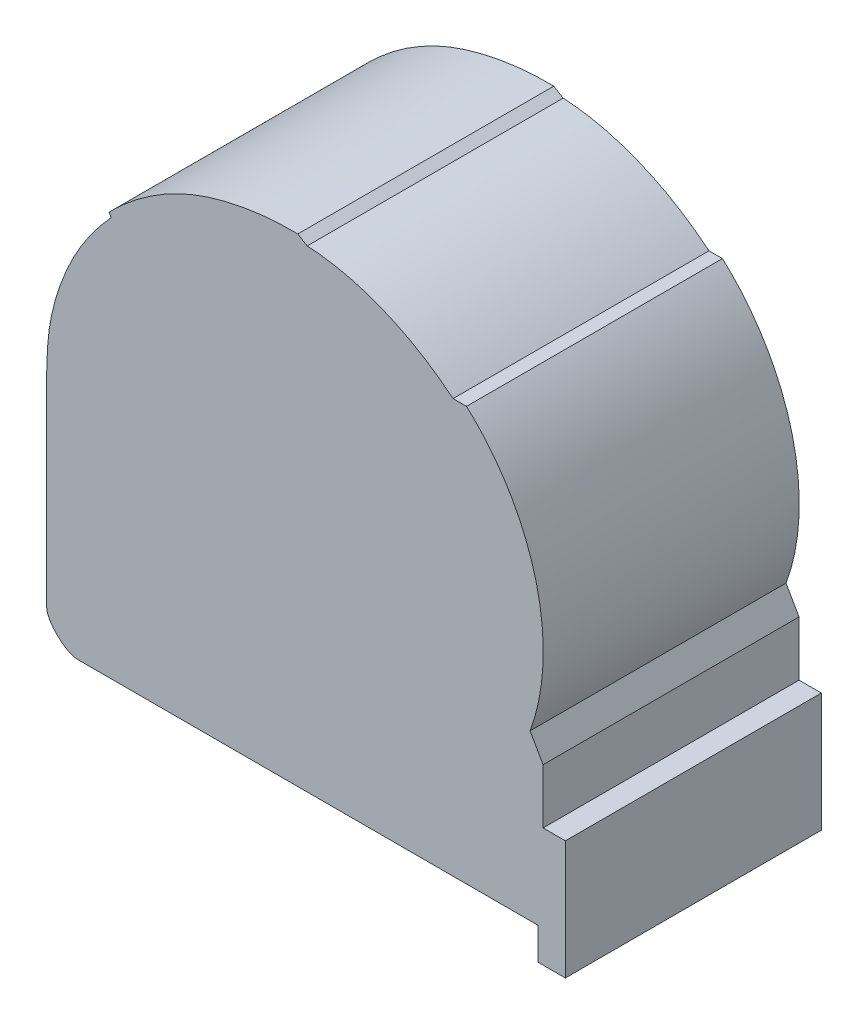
ISO-10303-21;
HEADER;
FILE_DESCRIPTION(('STEP AP214'),'2;1');
FILE_NAME('part.step','',(''),(''),'','','');
FILE_SCHEMA(('AUTOMOTIVE_DESIGN { 1 0 10303 214 1 1 1 1 }'));
ENDSEC;
DATA;
#1=APPLICATION_CONTEXT('core data for automotive mechanical design processes');
#2=APPLICATION_PROTOCOL_DEFINITION('international standard','automotive_design',2000,#1);
#3=PRODUCT_CONTEXT('',#1,'mechanical');
#4=PRODUCT('Part','Part','',(#3));
#5=PRODUCT_RELATED_PRODUCT_CATEGORY('part','',(#4));
#6=PRODUCT_DEFINITION_FORMATION('','',#4);
#7=PRODUCT_DEFINITION_CONTEXT('part definition',#1,'design');
#8=PRODUCT_DEFINITION('design','',#6,#7);
#9=PRODUCT_DEFINITION_SHAPE('','',#8);
#10=(LENGTH_UNIT() NAMED_UNIT(*) SI_UNIT(.MILLI.,.METRE.));
#11=(NAMED_UNIT(*) PLANE_ANGLE_UNIT() SI_UNIT($,.RADIAN.));
#12=(NAMED_UNIT(*) SI_UNIT($,.STERADIAN.) SOLID_ANGLE_UNIT());
#13=UNCERTAINTY_MEASURE_WITH_UNIT(LENGTH_MEASURE(1.E-05),#10,'distance_accuracy_value','');
#14=(GEOMETRIC_REPRESENTATION_CONTEXT(3) GLOBAL_UNCERTAINTY_ASSIGNED_CONTEXT((#13)) GLOBAL_UNIT_ASSIGNED_CONTEXT((#10,
#11,#12)) REPRESENTATION_CONTEXT('',''));
#15=CARTESIAN_POINT('',(0.,0.,0.));
#16=DIRECTION('',(0.,0.,1.));
#17=DIRECTION('',(1.,0.,0.));
#18=AXIS2_PLACEMENT_3D('',#15,#16,#17);
#19=CARTESIAN_POINT('',(-4.07433588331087,3.88304770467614,33.));
#20=CARTESIAN_POINT('',(-4.07433588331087,3.25454149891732,33.));
#21=CARTESIAN_POINT('',(-3.46541502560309,2.14685009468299,33.));
#22=CARTESIAN_POINT('',(-2.12049855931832,0.762348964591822,33.));
#23=CARTESIAN_POINT('',(-0.845653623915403,0.,33.));
#24=CARTESIAN_POINT('',(0.,0.,33.));
#25=B_SPLINE_CURVE_WITH_KNOTS('',3,(#19,#20,#21,#22,#23,#24),.UNSPECIFIED.,.F.,.F.,(4,1,1,4),
(0.,0.32203565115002,0.577642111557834,1.),.UNSPECIFIED.);
#26=DIRECTION('',(0.,0.,-1.));
#27=VECTOR('',#26,1.);
#28=SURFACE_OF_LINEAR_EXTRUSION('',#25,#27);
#29=CARTESIAN_POINT('',(-4.07433588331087,3.88304770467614,0.));
#30=CARTESIAN_POINT('',(-4.07433588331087,3.25454149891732,0.));
#31=CARTESIAN_POINT('',(-3.46541502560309,2.14685009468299,0.));
#32=CARTESIAN_POINT('',(-2.12049855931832,0.762348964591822,0.));
#33=CARTESIAN_POINT('',(-0.845653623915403,0.,0.));
#34=CARTESIAN_POINT('',(0.,0.,0.));
#35=B_SPLINE_CURVE_WITH_KNOTS('',3,(#29,#30,#31,#32,#33,#34),.UNSPECIFIED.,.F.,.F.,(4,1,1,4),
(0.,0.32203565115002,0.577642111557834,1.),.UNSPECIFIED.);
#36=CARTESIAN_POINT('',(-4.07433588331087,3.88304770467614,0.));
#37=VERTEX_POINT('',#36);
#38=CARTESIAN_POINT('',(0.,0.,0.));
#39=VERTEX_POINT('',#38);
#40=EDGE_CURVE('E200',#37,#39,#35,.T.);
#41=ORIENTED_EDGE('',*,*,#40,.T.);
#42=DIRECTION('',(0.,0.,-1.));
#43=VECTOR('',#42,1.);
#44=CARTESIAN_POINT('',(0.,0.,33.));
#45=LINE('',#44,#43);
#46=CARTESIAN_POINT('',(0.,0.,33.));
#47=VERTEX_POINT('',#46);
#48=EDGE_CURVE('E11',#47,#39,#45,.T.);
#49=ORIENTED_EDGE('',*,*,#48,.F.);
#50=CARTESIAN_POINT('',(-4.07433588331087,3.88304770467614,33.));
#51=VERTEX_POINT('',#50);
#52=EDGE_CURVE('E210',#51,#47,#25,.T.);
#53=ORIENTED_EDGE('',*,*,#52,.F.);
#54=DIRECTION('',(0.,0.,-1.));
#55=VECTOR('',#54,1.);
#56=CARTESIAN_POINT('',(-4.07433588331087,3.88304770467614,33.));
#57=LINE('',#56,#55);
#58=EDGE_CURVE('E369',#51,#37,#57,.T.);
#59=ORIENTED_EDGE('',*,*,#58,.T.);
#60=EDGE_LOOP('',(#41,#49,#53,#59));
#61=FACE_BOUND('',#60,.T.);
#62=ADVANCED_FACE('F39',(#61),#28,.F.);
#63=CARTESIAN_POINT('',(0.,0.,33.));
#64=DIRECTION('',(0.,1.,0.));
#65=DIRECTION('',(0.,0.,1.));
#66=AXIS2_PLACEMENT_3D('',#63,#64,#65);
#67=PLANE('',#66);
#68=DIRECTION('',(1.,0.,0.));
#69=VECTOR('',#68,1.);
#70=CARTESIAN_POINT('',(0.,0.,0.));
#71=LINE('',#70,#69);
#72=CARTESIAN_POINT('',(59.2961636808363,0.,0.));
#73=VERTEX_POINT('',#72);
#74=EDGE_CURVE('E205',#39,#73,#71,.T.);
#75=ORIENTED_EDGE('',*,*,#74,.T.);
#76=DIRECTION('',(0.,0.,-1.));
#77=VECTOR('',#76,1.);
#78=CARTESIAN_POINT('',(59.2961636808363,0.,33.));
#79=LINE('',#78,#77);
#80=CARTESIAN_POINT('',(59.2961636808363,0.,33.));
#81=VERTEX_POINT('',#80);
#82=EDGE_CURVE('E48',#81,#73,#79,.T.);
#83=ORIENTED_EDGE('',*,*,#82,.F.);
#84=DIRECTION('',(1.,0.,0.));
#85=VECTOR('',#84,1.);
#86=CARTESIAN_POINT('',(0.,0.,33.));
#87=LINE('',#86,#85);
#88=EDGE_CURVE('E217',#47,#81,#87,.T.);
#89=ORIENTED_EDGE('',*,*,#88,.F.);
#90=ORIENTED_EDGE('',*,*,#48,.T.);
#91=EDGE_LOOP('',(#75,#83,#89,#90));
#92=FACE_BOUND('',#91,.T.);
#93=ADVANCED_FACE('F283',(#92),#67,.F.);
#94=CARTESIAN_POINT('',(59.2961636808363,0.,33.));
#95=DIRECTION('',(1.,0.,0.));
#96=DIRECTION('',(0.,0.,-1.));
#97=AXIS2_PLACEMENT_3D('',#94,#95,#96);
#98=PLANE('',#97);
#99=DIRECTION('',(0.,-1.,0.));
#100=VECTOR('',#99,1.);
#101=CARTESIAN_POINT('',(59.2961636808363,0.,0.));
#102=LINE('',#101,#100);
#103=CARTESIAN_POINT('',(59.2961636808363,-4.12477551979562,0.));
#104=VERTEX_POINT('',#103);
#105=EDGE_CURVE('E299',#73,#104,#102,.T.);
#106=ORIENTED_EDGE('',*,*,#105,.T.);
#107=DIRECTION('',(0.,0.,-1.));
#108=VECTOR('',#107,1.);
#109=CARTESIAN_POINT('',(59.2961636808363,-4.12477551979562,33.));
#110=LINE('',#109,#108);
#111=CARTESIAN_POINT('',(59.2961636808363,-4.12477551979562,33.));
#112=VERTEX_POINT('',#111);
#113=EDGE_CURVE('E304',#112,#104,#110,.T.);
#114=ORIENTED_EDGE('',*,*,#113,.F.);
#115=DIRECTION('',(0.,-1.,0.));
#116=VECTOR('',#115,1.);
#117=CARTESIAN_POINT('',(59.2961636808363,0.,33.));
#118=LINE('',#117,#116);
#119=EDGE_CURVE('E224',#81,#112,#118,.T.);
#120=ORIENTED_EDGE('',*,*,#119,.F.);
#121=ORIENTED_EDGE('',*,*,#82,.T.);
#122=EDGE_LOOP('',(#106,#114,#120,#121));
#123=FACE_BOUND('',#122,.T.);
#124=ADVANCED_FACE('F280',(#123),#98,.F.);
#125=CARTESIAN_POINT('',(59.2961636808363,-4.12477551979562,33.));
#126=DIRECTION('',(0.,1.,0.));
#127=DIRECTION('',(0.,0.,1.));
#128=AXIS2_PLACEMENT_3D('',#125,#126,#127);
#129=PLANE('',#128);
#130=DIRECTION('',(1.,0.,0.));
#131=VECTOR('',#130,1.);
#132=CARTESIAN_POINT('',(59.2961636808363,-4.12477551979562,0.));
#133=LINE('',#132,#131);
#134=CARTESIAN_POINT('',(62.7961636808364,-4.12477551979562,0.));
#135=VERTEX_POINT('',#134);
#136=EDGE_CURVE('E308',#104,#135,#133,.T.);
#137=ORIENTED_EDGE('',*,*,#136,.T.);
#138=DIRECTION('',(0.,0.,-1.));
#139=VECTOR('',#138,1.);
#140=CARTESIAN_POINT('',(62.7961636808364,-4.12477551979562,33.));
#141=LINE('',#140,#139);
#142=CARTESIAN_POINT('',(62.7961636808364,-4.12477551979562,33.));
#143=VERTEX_POINT('',#142);
#144=EDGE_CURVE('E418',#143,#135,#141,.T.);
#145=ORIENTED_EDGE('',*,*,#144,.F.);
#146=DIRECTION('',(1.,0.,0.));
#147=VECTOR('',#146,1.);
#148=CARTESIAN_POINT('',(59.2961636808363,-4.12477551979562,33.));
#149=LINE('',#148,#147);
#150=EDGE_CURVE('E227',#112,#143,#149,.T.);
#151=ORIENTED_EDGE('',*,*,#150,.F.);
#152=ORIENTED_EDGE('',*,*,#113,.T.);
#153=EDGE_LOOP('',(#137,#145,#151,#152));
#154=FACE_BOUND('',#153,.T.);
#155=ADVANCED_FACE('F276',(#154),#129,.F.);
#156=CARTESIAN_POINT('',(62.7961636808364,-4.12477551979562,33.));
#157=DIRECTION('',(-1.,0.,0.));
#158=DIRECTION('',(0.,0.,1.));
#159=AXIS2_PLACEMENT_3D('',#156,#157,#158);
#160=PLANE('',#159);
#161=DIRECTION('',(0.,1.,0.));
#162=VECTOR('',#161,1.);
#163=CARTESIAN_POINT('',(62.7961636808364,-4.12477551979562,0.));
#164=LINE('',#163,#162);
#165=CARTESIAN_POINT('',(62.7961636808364,11.1930684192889,0.));
#166=VERTEX_POINT('',#165);
#167=EDGE_CURVE('E312',#135,#166,#164,.T.);
#168=ORIENTED_EDGE('',*,*,#167,.T.);
#169=DIRECTION('',(0.,0.,-1.));
#170=VECTOR('',#169,1.);
#171=CARTESIAN_POINT('',(62.7961636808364,11.1930684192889,33.));
#172=LINE('',#171,#170);
#173=CARTESIAN_POINT('',(62.7961636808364,11.1930684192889,33.));
#174=VERTEX_POINT('',#173);
#175=EDGE_CURVE('E414',#174,#166,#172,.T.);
#176=ORIENTED_EDGE('',*,*,#175,.F.);
#177=DIRECTION('',(0.,1.,0.));
#178=VECTOR('',#177,1.);
#179=CARTESIAN_POINT('',(62.7961636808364,-4.12477551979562,33.));
#180=LINE('',#179,#178);
#181=EDGE_CURVE('E230',#143,#174,#180,.T.);
#182=ORIENTED_EDGE('',*,*,#181,.F.);
#183=ORIENTED_EDGE('',*,*,#144,.T.);
#184=EDGE_LOOP('',(#168,#176,#182,#183));
#185=FACE_BOUND('',#184,.T.);
#186=ADVANCED_FACE('F272',(#185),#160,.F.);
#187=CARTESIAN_POINT('',(62.7961636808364,11.1930684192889,33.));
#188=DIRECTION('',(0.,-1.,0.));
#189=DIRECTION('',(0.,0.,-1.));
#190=AXIS2_PLACEMENT_3D('',#187,#188,#189);
#191=PLANE('',#190);
#192=DIRECTION('',(-1.,0.,0.));
#193=VECTOR('',#192,1.);
#194=CARTESIAN_POINT('',(62.7961636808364,11.1930684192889,0.));
#195=LINE('',#194,#193);
#196=CARTESIAN_POINT('',(59.9256641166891,11.1930684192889,0.));
#197=VERTEX_POINT('',#196);
#198=EDGE_CURVE('E317',#166,#197,#195,.T.);
#199=ORIENTED_EDGE('',*,*,#198,.T.);
#200=DIRECTION('',(0.,0.,-1.));
#201=VECTOR('',#200,1.);
#202=CARTESIAN_POINT('',(59.9256641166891,11.1930684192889,33.));
#203=LINE('',#202,#201);
#204=CARTESIAN_POINT('',(59.9256641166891,11.1930684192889,33.));
#205=VERTEX_POINT('',#204);
#206=EDGE_CURVE('E410',#205,#197,#203,.T.);
#207=ORIENTED_EDGE('',*,*,#206,.F.);
#208=DIRECTION('',(-1.,0.,0.));
#209=VECTOR('',#208,1.);
#210=CARTESIAN_POINT('',(62.7961636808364,11.1930684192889,33.));
#211=LINE('',#210,#209);
#212=EDGE_CURVE('E233',#174,#205,#211,.T.);
#213=ORIENTED_EDGE('',*,*,#212,.F.);
#214=ORIENTED_EDGE('',*,*,#175,.T.);
#215=EDGE_LOOP('',(#199,#207,#213,#214));
#216=FACE_BOUND('',#215,.T.);
#217=ADVANCED_FACE('F268',(#216),#191,.F.);
#218=CARTESIAN_POINT('',(59.9256641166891,11.1930684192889,33.));
#219=DIRECTION('',(-1.,0.,0.));
#220=DIRECTION('',(0.,0.,1.));
#221=AXIS2_PLACEMENT_3D('',#218,#219,#220);
#222=PLANE('',#221);
#223=DIRECTION('',(0.,1.,0.));
#224=VECTOR('',#223,1.);
#225=CARTESIAN_POINT('',(59.9256641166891,11.1930684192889,0.));
#226=LINE('',#225,#224);
#227=CARTESIAN_POINT('',(59.9256641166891,18.2574621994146,0.));
#228=VERTEX_POINT('',#227);
#229=EDGE_CURVE('E320',#197,#228,#226,.T.);
#230=ORIENTED_EDGE('',*,*,#229,.T.);
#231=DIRECTION('',(0.,0.,-1.));
#232=VECTOR('',#231,1.);
#233=CARTESIAN_POINT('',(59.9256641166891,18.2574621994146,33.));
#234=LINE('',#233,#232);
#235=CARTESIAN_POINT('',(59.9256641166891,18.2574621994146,33.));
#236=VERTEX_POINT('',#235);
#237=EDGE_CURVE('E406',#236,#228,#234,.T.);
#238=ORIENTED_EDGE('',*,*,#237,.F.);
#239=DIRECTION('',(0.,1.,0.));
#240=VECTOR('',#239,1.);
#241=CARTESIAN_POINT('',(59.9256641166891,11.1930684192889,33.));
#242=LINE('',#241,#240);
#243=EDGE_CURVE('E236',#205,#236,#242,.T.);
#244=ORIENTED_EDGE('',*,*,#243,.F.);
#245=ORIENTED_EDGE('',*,*,#206,.T.);
#246=EDGE_LOOP('',(#230,#238,#244,#245));
#247=FACE_BOUND('',#246,.T.);
#248=ADVANCED_FACE('F264',(#247),#222,.F.);
#249=CARTESIAN_POINT('',(59.9256641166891,18.2574621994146,33.));
#250=DIRECTION('',(-0.868243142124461,-0.49613893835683,0.));
#251=DIRECTION('',(0.49613893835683,-0.868243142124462,0.));
#252=AXIS2_PLACEMENT_3D('',#249,#250,#251);
#253=PLANE('',#252);
#254=DIRECTION('',(-0.49613893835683,0.868243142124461,0.));
#255=VECTOR('',#254,1.);
#256=CARTESIAN_POINT('',(59.9256641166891,18.2574621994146,0.));
#257=LINE('',#256,#255);
#258=CARTESIAN_POINT('',(58.2469962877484,21.195130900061,0.));
#259=VERTEX_POINT('',#258);
#260=EDGE_CURVE('E323',#228,#259,#257,.T.);
#261=ORIENTED_EDGE('',*,*,#260,.T.);
#262=DIRECTION('',(0.,0.,-1.));
#263=VECTOR('',#262,1.);
#264=CARTESIAN_POINT('',(58.2469962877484,21.195130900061,33.));
#265=LINE('',#264,#263);
#266=CARTESIAN_POINT('',(58.2469962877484,21.195130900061,33.));
#267=VERTEX_POINT('',#266);
#268=EDGE_CURVE('E402',#267,#259,#265,.T.);
#269=ORIENTED_EDGE('',*,*,#268,.F.);
#270=DIRECTION('',(-0.49613893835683,0.868243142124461,0.));
#271=VECTOR('',#270,1.);
#272=CARTESIAN_POINT('',(59.9256641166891,18.2574621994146,33.));
#273=LINE('',#272,#271);
#274=EDGE_CURVE('E239',#236,#267,#273,.T.);
#275=ORIENTED_EDGE('',*,*,#274,.F.);
#276=ORIENTED_EDGE('',*,*,#237,.T.);
#277=EDGE_LOOP('',(#261,#269,#275,#276));
#278=FACE_BOUND('',#277,.T.);
#279=ADVANCED_FACE('F259',(#278),#253,.F.);
#280=CARTESIAN_POINT('',(58.2469962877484,21.195130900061,33.));
#281=CARTESIAN_POINT('',(59.7340703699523,25.2058668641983,33.));
#282=CARTESIAN_POINT('',(61.0733717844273,37.1119587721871,33.));
#283=CARTESIAN_POINT('',(55.5968499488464,48.294383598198,33.));
#284=CARTESIAN_POINT('',(50.051226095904,53.3278054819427,33.));
#285=B_SPLINE_CURVE_WITH_KNOTS('',3,(#280,#281,#282,#283,#284),.UNSPECIFIED.,.F.,.F.,(4,1,4),
(0.,0.366433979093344,1.),.UNSPECIFIED.);
#286=DIRECTION('',(0.,0.,-1.));
#287=VECTOR('',#286,1.);
#288=SURFACE_OF_LINEAR_EXTRUSION('',#285,#287);
#289=CARTESIAN_POINT('',(58.2469962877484,21.195130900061,0.));
#290=CARTESIAN_POINT('',(59.7340703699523,25.2058668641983,0.));
#291=CARTESIAN_POINT('',(61.0733717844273,37.1119587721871,0.));
#292=CARTESIAN_POINT('',(55.5968499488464,48.294383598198,0.));
#293=CARTESIAN_POINT('',(50.051226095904,53.3278054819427,0.));
#294=B_SPLINE_CURVE_WITH_KNOTS('',3,(#289,#290,#291,#292,#293),.UNSPECIFIED.,.F.,.F.,(4,1,4),
(0.,0.366433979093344,1.),.UNSPECIFIED.);
#295=CARTESIAN_POINT('',(50.051226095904,53.3278054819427,0.));
#296=VERTEX_POINT('',#295);
#297=EDGE_CURVE('E326',#259,#296,#294,.T.);
#298=ORIENTED_EDGE('',*,*,#297,.T.);
#299=DIRECTION('',(0.,0.,-1.));
#300=VECTOR('',#299,1.);
#301=CARTESIAN_POINT('',(50.051226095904,53.3278054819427,33.));
#302=LINE('',#301,#300);
#303=CARTESIAN_POINT('',(50.051226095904,53.3278054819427,33.));
#304=VERTEX_POINT('',#303);
#305=EDGE_CURVE('E398',#304,#296,#302,.T.);
#306=ORIENTED_EDGE('',*,*,#305,.F.);
#307=EDGE_CURVE('E242',#267,#304,#285,.T.);
#308=ORIENTED_EDGE('',*,*,#307,.F.);
#309=ORIENTED_EDGE('',*,*,#268,.T.);
#310=EDGE_LOOP('',(#298,#306,#308,#309));
#311=FACE_BOUND('',#310,.T.);
#312=ADVANCED_FACE('F254',(#311),#288,.F.);
#313=CARTESIAN_POINT('',(50.051226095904,53.3278054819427,33.));
#314=DIRECTION('',(0.,-1.,0.));
#315=DIRECTION('',(0.,0.,-1.));
#316=AXIS2_PLACEMENT_3D('',#313,#314,#315);
#317=PLANE('',#316);
#318=DIRECTION('',(-1.,0.,0.));
#319=VECTOR('',#318,1.);
#320=CARTESIAN_POINT('',(50.051226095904,53.3278054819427,0.));
#321=LINE('',#320,#319);
#322=CARTESIAN_POINT('',(48.3164308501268,53.3278054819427,0.));
#323=VERTEX_POINT('',#322);
#324=EDGE_CURVE('E331',#296,#323,#321,.T.);
#325=ORIENTED_EDGE('',*,*,#324,.T.);
#326=DIRECTION('',(0.,0.,-1.));
#327=VECTOR('',#326,1.);
#328=CARTESIAN_POINT('',(48.3164308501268,53.3278054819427,33.));
#329=LINE('',#328,#327);
#330=CARTESIAN_POINT('',(48.3164308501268,53.3278054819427,33.));
#331=VERTEX_POINT('',#330);
#332=EDGE_CURVE('E394',#331,#323,#329,.T.);
#333=ORIENTED_EDGE('',*,*,#332,.F.);
#334=DIRECTION('',(-1.,0.,0.));
#335=VECTOR('',#334,1.);
#336=CARTESIAN_POINT('',(50.051226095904,53.3278054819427,33.));
#337=LINE('',#336,#335);
#338=EDGE_CURVE('E248',#304,#331,#337,.T.);
#339=ORIENTED_EDGE('',*,*,#338,.F.);
#340=ORIENTED_EDGE('',*,*,#305,.T.);
#341=EDGE_LOOP('',(#325,#333,#339,#340));
#342=FACE_BOUND('',#341,.T.);
#343=ADVANCED_FACE('F258',(#342),#317,.F.);
#344=CARTESIAN_POINT('',(48.3164308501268,53.3278054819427,33.));
#345=CARTESIAN_POINT('',(43.0192101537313,57.6663328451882,33.));
#346=CARTESIAN_POINT('',(36.4104359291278,60.6073949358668,33.));
#347=CARTESIAN_POINT('',(29.5120258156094,60.972571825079,33.));
#348=B_SPLINE_CURVE_WITH_KNOTS('',3,(#344,#345,#346,#347),.UNSPECIFIED.,.F.,.F.,(4,4),(0.,1.),.UNSPECIFIED.);
#349=DIRECTION('',(0.,0.,-1.));
#350=VECTOR('',#349,1.);
#351=SURFACE_OF_LINEAR_EXTRUSION('',#348,#350);
#352=CARTESIAN_POINT('',(48.3164308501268,53.3278054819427,0.));
#353=CARTESIAN_POINT('',(43.0192101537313,57.6663328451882,0.));
#354=CARTESIAN_POINT('',(36.4104359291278,60.6073949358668,0.));
#355=CARTESIAN_POINT('',(29.5120258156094,60.972571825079,0.));
#356=B_SPLINE_CURVE_WITH_KNOTS('',3,(#352,#353,#354,#355),.UNSPECIFIED.,.F.,.F.,(4,4),(0.,1.),.UNSPECIFIED.);
#357=CARTESIAN_POINT('',(29.5120258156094,60.972571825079,0.));
#358=VERTEX_POINT('',#357);
#359=EDGE_CURVE('E337',#323,#358,#356,.T.);
#360=ORIENTED_EDGE('',*,*,#359,.T.);
#361=DIRECTION('',(0.,0.,-1.));
#362=VECTOR('',#361,1.);
#363=CARTESIAN_POINT('',(29.5120258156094,60.972571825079,33.));
#364=LINE('',#363,#362);
#365=CARTESIAN_POINT('',(29.5120258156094,60.972571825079,33.));
#366=VERTEX_POINT('',#365);
#367=EDGE_CURVE('E390',#366,#358,#364,.T.);
#368=ORIENTED_EDGE('',*,*,#367,.F.);
#369=EDGE_CURVE('E464',#331,#366,#348,.T.);
#370=ORIENTED_EDGE('',*,*,#369,.F.);
#371=ORIENTED_EDGE('',*,*,#332,.T.);
#372=EDGE_LOOP('',(#360,#368,#370,#371));
#373=FACE_BOUND('',#372,.T.);
#374=ADVANCED_FACE('F463',(#373),#351,.F.);
#375=CARTESIAN_POINT('',(29.5120258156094,60.972571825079,33.));
#376=DIRECTION('',(-0.516109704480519,-0.856522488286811,0.));
#377=DIRECTION('',(0.856522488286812,-0.516109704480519,0.));
#378=AXIS2_PLACEMENT_3D('',#375,#376,#377);
#379=PLANE('',#378);
#380=DIRECTION('',(-0.856522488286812,0.516109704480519,0.));
#381=VECTOR('',#380,1.);
#382=CARTESIAN_POINT('',(29.5120258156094,60.972571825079,0.));
#383=LINE('',#382,#381);
#384=CARTESIAN_POINT('',(28.3004190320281,61.7026425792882,0.));
#385=VERTEX_POINT('',#384);
#386=EDGE_CURVE('E342',#358,#385,#383,.T.);
#387=ORIENTED_EDGE('',*,*,#386,.T.);
#388=DIRECTION('',(0.,0.,-1.));
#389=VECTOR('',#388,1.);
#390=CARTESIAN_POINT('',(28.3004190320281,61.7026425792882,33.));
#391=LINE('',#390,#389);
#392=CARTESIAN_POINT('',(28.3004190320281,61.7026425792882,33.));
#393=VERTEX_POINT('',#392);
#394=EDGE_CURVE('E386',#393,#385,#391,.T.);
#395=ORIENTED_EDGE('',*,*,#394,.F.);
#396=DIRECTION('',(-0.856522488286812,0.516109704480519,0.));
#397=VECTOR('',#396,1.);
#398=CARTESIAN_POINT('',(29.5120258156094,60.972571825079,33.));
#399=LINE('',#398,#397);
#400=EDGE_CURVE('E459',#366,#393,#399,.T.);
#401=ORIENTED_EDGE('',*,*,#400,.F.);
#402=ORIENTED_EDGE('',*,*,#367,.T.);
#403=EDGE_LOOP('',(#387,#395,#401,#402));
#404=FACE_BOUND('',#403,.T.);
#405=ADVANCED_FACE('F458',(#404),#379,.F.);
#406=CARTESIAN_POINT('',(28.3004190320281,61.7026425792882,33.));
#407=CARTESIAN_POINT('',(25.39520121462,61.7656644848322,33.));
#408=CARTESIAN_POINT('',(20.695880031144,61.2709789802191,33.));
#409=CARTESIAN_POINT('',(12.0639076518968,58.6472655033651,33.));
#410=CARTESIAN_POINT('',(6.94677338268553,55.0591208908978,33.));
#411=CARTESIAN_POINT('',(3.97632631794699,51.9747084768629,33.));
#412=B_SPLINE_CURVE_WITH_KNOTS('',3,(#406,#407,#408,#409,#410,#411),.UNSPECIFIED.,.F.,.F.,(4,1,
1,4),(0.,0.323379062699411,0.522175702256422,1.),.UNSPECIFIED.);
#413=DIRECTION('',(0.,0.,-1.));
#414=VECTOR('',#413,1.);
#415=SURFACE_OF_LINEAR_EXTRUSION('',#412,#414);
#416=CARTESIAN_POINT('',(28.3004190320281,61.7026425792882,0.));
#417=CARTESIAN_POINT('',(25.39520121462,61.7656644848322,0.));
#418=CARTESIAN_POINT('',(20.695880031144,61.2709789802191,0.));
#419=CARTESIAN_POINT('',(12.0639076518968,58.6472655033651,0.));
#420=CARTESIAN_POINT('',(6.94677338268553,55.0591208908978,0.));
#421=CARTESIAN_POINT('',(3.97632631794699,51.9747084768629,0.));
#422=B_SPLINE_CURVE_WITH_KNOTS('',3,(#416,#417,#418,#419,#420,#421),.UNSPECIFIED.,.F.,.F.,(4,1,
1,4),(0.,0.323379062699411,0.522175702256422,1.),.UNSPECIFIED.);
#423=CARTESIAN_POINT('',(3.97632631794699,51.9747084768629,0.));
#424=VERTEX_POINT('',#423);
#425=EDGE_CURVE('E348',#385,#424,#422,.T.);
#426=ORIENTED_EDGE('',*,*,#425,.T.);
#427=DIRECTION('',(0.,0.,-1.));
#428=VECTOR('',#427,1.);
#429=CARTESIAN_POINT('',(3.97632631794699,51.9747084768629,33.));
#430=LINE('',#429,#428);
#431=CARTESIAN_POINT('',(3.97632631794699,51.9747084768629,33.));
#432=VERTEX_POINT('',#431);
#433=EDGE_CURVE('E382',#432,#424,#430,.T.);
#434=ORIENTED_EDGE('',*,*,#433,.F.);
#435=EDGE_CURVE('E455',#393,#432,#412,.T.);
#436=ORIENTED_EDGE('',*,*,#435,.F.);
#437=ORIENTED_EDGE('',*,*,#394,.T.);
#438=EDGE_LOOP('',(#426,#434,#436,#437));
#439=FACE_BOUND('',#438,.T.);
#440=ADVANCED_FACE('F452',(#439),#415,.F.);
#441=CARTESIAN_POINT('',(3.97632631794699,51.9747084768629,33.));
#442=DIRECTION('',(0.868243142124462,0.496138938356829,0.));
#443=DIRECTION('',(-0.496138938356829,0.868243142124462,0.));
#444=AXIS2_PLACEMENT_3D('',#441,#442,#443);
#445=PLANE('',#444);
#446=DIRECTION('',(0.496138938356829,-0.868243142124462,0.));
#447=VECTOR('',#446,1.);
#448=CARTESIAN_POINT('',(3.97632631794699,51.9747084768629,0.));
#449=LINE('',#448,#447);
#450=CARTESIAN_POINT('',(4.24516084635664,51.504248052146,0.));
#451=VERTEX_POINT('',#450);
#452=EDGE_CURVE('E353',#424,#451,#449,.T.);
#453=ORIENTED_EDGE('',*,*,#452,.T.);
#454=DIRECTION('',(0.,0.,-1.));
#455=VECTOR('',#454,1.);
#456=CARTESIAN_POINT('',(4.24516084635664,51.504248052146,33.));
#457=LINE('',#456,#455);
#458=CARTESIAN_POINT('',(4.24516084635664,51.504248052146,33.));
#459=VERTEX_POINT('',#458);
#460=EDGE_CURVE('E378',#459,#451,#457,.T.);
#461=ORIENTED_EDGE('',*,*,#460,.F.);
#462=DIRECTION('',(0.496138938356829,-0.868243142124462,0.));
#463=VECTOR('',#462,1.);
#464=CARTESIAN_POINT('',(3.97632631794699,51.9747084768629,33.));
#465=LINE('',#464,#463);
#466=EDGE_CURVE('E446',#432,#459,#465,.T.);
#467=ORIENTED_EDGE('',*,*,#466,.F.);
#468=ORIENTED_EDGE('',*,*,#433,.T.);
#469=EDGE_LOOP('',(#453,#461,#467,#468));
#470=FACE_BOUND('',#469,.T.);
#471=ADVANCED_FACE('F445',(#470),#445,.F.);
#472=CARTESIAN_POINT('',(4.24516084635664,51.504248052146,33.));
#473=CARTESIAN_POINT('',(2.47182790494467,49.5737503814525,33.));
#474=CARTESIAN_POINT('',(-0.26082995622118,45.8505388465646,33.));
#475=CARTESIAN_POINT('',(-2.60230313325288,40.2800982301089,33.));
#476=CARTESIAN_POINT('',(-4.10621228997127,34.3643775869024,33.));
#477=CARTESIAN_POINT('',(-4.082601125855,30.1848502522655,33.));
#478=CARTESIAN_POINT('',(-4.07433588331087,27.5041152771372,33.));
#479=B_SPLINE_CURVE_WITH_KNOTS('',3,(#472,#473,#474,#475,#476,#477,#478),.UNSPECIFIED.,.F.,.F.,
(4,1,1,1,4),(0.,0.301498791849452,0.525501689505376,0.6903373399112,1.),.UNSPECIFIED.);
#480=DIRECTION('',(0.,0.,-1.));
#481=VECTOR('',#480,1.);
#482=SURFACE_OF_LINEAR_EXTRUSION('',#479,#481);
#483=CARTESIAN_POINT('',(4.24516084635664,51.504248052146,0.));
#484=CARTESIAN_POINT('',(2.47182790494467,49.5737503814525,0.));
#485=CARTESIAN_POINT('',(-0.26082995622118,45.8505388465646,0.));
#486=CARTESIAN_POINT('',(-2.60230313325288,40.2800982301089,0.));
#487=CARTESIAN_POINT('',(-4.10621228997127,34.3643775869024,0.));
#488=CARTESIAN_POINT('',(-4.082601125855,30.1848502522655,0.));
#489=CARTESIAN_POINT('',(-4.07433588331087,27.5041152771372,0.));
#490=B_SPLINE_CURVE_WITH_KNOTS('',3,(#483,#484,#485,#486,#487,#488,#489),.UNSPECIFIED.,.F.,.F.,
(4,1,1,1,4),(0.,0.301498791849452,0.525501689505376,0.6903373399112,1.),.UNSPECIFIED.);
#491=CARTESIAN_POINT('',(-4.07433588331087,27.5041152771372,0.));
#492=VERTEX_POINT('',#491);
#493=EDGE_CURVE('E359',#451,#492,#490,.T.);
#494=ORIENTED_EDGE('',*,*,#493,.T.);
#495=DIRECTION('',(0.,0.,-1.));
#496=VECTOR('',#495,1.);
#497=CARTESIAN_POINT('',(-4.07433588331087,27.5041152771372,33.));
#498=LINE('',#497,#496);
#499=CARTESIAN_POINT('',(-4.07433588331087,27.5041152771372,33.));
#500=VERTEX_POINT('',#499);
#501=EDGE_CURVE('E373',#500,#492,#498,.T.);
#502=ORIENTED_EDGE('',*,*,#501,.F.);
#503=EDGE_CURVE('E441',#459,#500,#479,.T.);
#504=ORIENTED_EDGE('',*,*,#503,.F.);
#505=ORIENTED_EDGE('',*,*,#460,.T.);
#506=EDGE_LOOP('',(#494,#502,#504,#505));
#507=FACE_BOUND('',#506,.T.);
#508=ADVANCED_FACE('F440',(#507),#482,.F.);
#509=CARTESIAN_POINT('',(-4.07433588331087,3.88304770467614,33.));
#510=DIRECTION('',(1.,0.,0.));
#511=DIRECTION('',(0.,0.,-1.));
#512=AXIS2_PLACEMENT_3D('',#509,#510,#511);
#513=PLANE('',#512);
#514=DIRECTION('',(0.,-1.,0.));
#515=VECTOR('',#514,1.);
#516=CARTESIAN_POINT('',(-4.07433588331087,3.88304770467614,0.));
#517=LINE('',#516,#515);
#518=EDGE_CURVE('E218',#492,#37,#517,.T.);
#519=ORIENTED_EDGE('',*,*,#518,.T.);
#520=ORIENTED_EDGE('',*,*,#58,.F.);
#521=DIRECTION('',(0.,-1.,0.));
#522=VECTOR('',#521,1.);
#523=CARTESIAN_POINT('',(-4.07433588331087,3.88304770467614,33.));
#524=LINE('',#523,#522);
#525=EDGE_CURVE('E374',#500,#51,#524,.T.);
#526=ORIENTED_EDGE('',*,*,#525,.F.);
#527=ORIENTED_EDGE('',*,*,#501,.T.);
#528=EDGE_LOOP('',(#519,#520,#526,#527));
#529=FACE_BOUND('',#528,.T.);
#530=ADVANCED_FACE('F436',(#529),#513,.F.);
#531=CARTESIAN_POINT('',(-2.63969326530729,1.32585088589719,33.));
#532=DIRECTION('',(0.,0.,-1.));
#533=DIRECTION('',(-1.,0.,0.));
#534=AXIS2_PLACEMENT_3D('',#531,#532,#533);
#535=PLANE('',#534);
#536=ORIENTED_EDGE('',*,*,#52,.T.);
#537=ORIENTED_EDGE('',*,*,#88,.T.);
#538=ORIENTED_EDGE('',*,*,#119,.T.);
#539=ORIENTED_EDGE('',*,*,#150,.T.);
#540=ORIENTED_EDGE('',*,*,#181,.T.);
#541=ORIENTED_EDGE('',*,*,#212,.T.);
#542=ORIENTED_EDGE('',*,*,#243,.T.);
#543=ORIENTED_EDGE('',*,*,#274,.T.);
#544=ORIENTED_EDGE('',*,*,#307,.T.);
#545=ORIENTED_EDGE('',*,*,#338,.T.);
#546=ORIENTED_EDGE('',*,*,#369,.T.);
#547=ORIENTED_EDGE('',*,*,#400,.T.);
#548=ORIENTED_EDGE('',*,*,#435,.T.);
#549=ORIENTED_EDGE('',*,*,#466,.T.);
#550=ORIENTED_EDGE('',*,*,#503,.T.);
#551=ORIENTED_EDGE('',*,*,#525,.T.);
#552=EDGE_LOOP('',(#536,#537,#538,#539,#540,#541,#542,#543,#544,#545,#546,#547,#548,#549,#550,#551));
#553=FACE_BOUND('',#552,.T.);
#554=ADVANCED_FACE('F427',(#553),#535,.F.);
#555=CARTESIAN_POINT('',(-2.63969326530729,1.32585088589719,0.));
#556=DIRECTION('',(0.,0.,-1.));
#557=DIRECTION('',(-1.,0.,0.));
#558=AXIS2_PLACEMENT_3D('',#555,#556,#557);
#559=PLANE('',#558);
#560=DIRECTION('',(0.,1.,0.));
#561=VECTOR('',#560,1.);
#562=CARTESIAN_POINT('',(11.9256641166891,9.,0.));
#563=LINE('',#562,#561);
#564=CARTESIAN_POINT('',(11.9256641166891,9.,0.));
#565=VERTEX_POINT('',#564);
#566=CARTESIAN_POINT('',(11.9256641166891,46.,0.));
#567=VERTEX_POINT('',#566);
#568=EDGE_CURVE('E55',#565,#567,#563,.T.);
#569=ORIENTED_EDGE('',*,*,#568,.F.);
#570=DIRECTION('',(-1.,0.,0.));
#571=VECTOR('',#570,1.);
#572=CARTESIAN_POINT('',(11.9256641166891,9.,0.));
#573=LINE('',#572,#571);
#574=CARTESIAN_POINT('',(33.9256641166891,9.,0.));
#575=VERTEX_POINT('',#574);
#576=EDGE_CURVE('E59',#575,#565,#573,.T.);
#577=ORIENTED_EDGE('',*,*,#576,.F.);
#578=DIRECTION('',(0.,-1.,0.));
#579=VECTOR('',#578,1.);
#580=CARTESIAN_POINT('',(33.9256641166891,9.,0.));
#581=LINE('',#580,#579);
#582=CARTESIAN_POINT('',(33.9256641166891,46.,0.));
#583=VERTEX_POINT('',#582);
#584=EDGE_CURVE('E680',#583,#575,#581,.T.);
#585=ORIENTED_EDGE('',*,*,#584,.F.);
#586=DIRECTION('',(1.,0.,0.));
#587=VECTOR('',#586,1.);
#588=CARTESIAN_POINT('',(11.9256641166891,46.,0.));
#589=LINE('',#588,#587);
#590=EDGE_CURVE('E690',#567,#583,#589,.T.);
#591=ORIENTED_EDGE('',*,*,#590,.F.);
#592=EDGE_LOOP('',(#569,#577,#585,#591));
#593=FACE_BOUND('',#592,.T.);
#594=ORIENTED_EDGE('',*,*,#40,.F.);
#595=ORIENTED_EDGE('',*,*,#518,.F.);
#596=ORIENTED_EDGE('',*,*,#493,.F.);
#597=ORIENTED_EDGE('',*,*,#452,.F.);
#598=ORIENTED_EDGE('',*,*,#425,.F.);
#599=ORIENTED_EDGE('',*,*,#386,.F.);
#600=ORIENTED_EDGE('',*,*,#359,.F.);
#601=ORIENTED_EDGE('',*,*,#324,.F.);
#602=ORIENTED_EDGE('',*,*,#297,.F.);
#603=ORIENTED_EDGE('',*,*,#260,.F.);
#604=ORIENTED_EDGE('',*,*,#229,.F.);
#605=ORIENTED_EDGE('',*,*,#198,.F.);
#606=ORIENTED_EDGE('',*,*,#167,.F.);
#607=ORIENTED_EDGE('',*,*,#136,.F.);
#608=ORIENTED_EDGE('',*,*,#105,.F.);
#609=ORIENTED_EDGE('',*,*,#74,.F.);
#610=EDGE_LOOP('',(#594,#595,#596,#597,#598,#599,#600,#601,#602,#603,#604,#605,#606,#607,#608,#609));
#611=FACE_BOUND('',#610,.T.);
#612=ADVANCED_FACE('F306',(#593,#611),#559,.T.);
#613=CARTESIAN_POINT('',(11.9256641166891,9.,-7.));
#614=DIRECTION('',(1.,0.,0.));
#615=DIRECTION('',(0.,0.,-1.));
#616=AXIS2_PLACEMENT_3D('',#613,#614,#615);
#617=PLANE('',#616);
#618=ORIENTED_EDGE('',*,*,#568,.T.);
#619=DIRECTION('',(0.,0.,1.));
#620=VECTOR('',#619,1.);
#621=CARTESIAN_POINT('',(11.9256641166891,46.,-7.));
#622=LINE('',#621,#620);
#623=CARTESIAN_POINT('',(11.9256641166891,46.,-7.));
#624=VERTEX_POINT('',#623);
#625=EDGE_CURVE('E180',#624,#567,#622,.T.);
#626=ORIENTED_EDGE('',*,*,#625,.F.);
#627=DIRECTION('',(0.,1.,0.));
#628=VECTOR('',#627,1.);
#629=CARTESIAN_POINT('',(11.9256641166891,9.,-7.));
#630=LINE('',#629,#628);
#631=CARTESIAN_POINT('',(11.9256641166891,9.,-7.));
#632=VERTEX_POINT('',#631);
#633=EDGE_CURVE('E187',#632,#624,#630,.T.);
#634=ORIENTED_EDGE('',*,*,#633,.F.);
#635=DIRECTION('',(0.,0.,1.));
#636=VECTOR('',#635,1.);
#637=CARTESIAN_POINT('',(11.9256641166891,9.,-7.));
#638=LINE('',#637,#636);
#639=EDGE_CURVE('E677',#632,#565,#638,.T.);
#640=ORIENTED_EDGE('',*,*,#639,.T.);
#641=EDGE_LOOP('',(#618,#626,#634,#640));
#642=FACE_BOUND('',#641,.T.);
#643=ADVANCED_FACE('F198',(#642),#617,.F.);
#644=CARTESIAN_POINT('',(11.9256641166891,46.,-7.));
#645=DIRECTION('',(0.,-1.,0.));
#646=DIRECTION('',(1.,0.,0.));
#647=AXIS2_PLACEMENT_3D('',#644,#645,#646);
#648=PLANE('',#647);
#649=ORIENTED_EDGE('',*,*,#590,.T.);
#650=DIRECTION('',(0.,0.,1.));
#651=VECTOR('',#650,1.);
#652=CARTESIAN_POINT('',(33.9256641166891,46.,-7.));
#653=LINE('',#652,#651);
#654=CARTESIAN_POINT('',(33.9256641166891,46.,-7.));
#655=VERTEX_POINT('',#654);
#656=EDGE_CURVE('E182',#655,#583,#653,.T.);
#657=ORIENTED_EDGE('',*,*,#656,.F.);
#658=DIRECTION('',(1.,0.,0.));
#659=VECTOR('',#658,1.);
#660=CARTESIAN_POINT('',(11.9256641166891,46.,-7.));
#661=LINE('',#660,#659);
#662=EDGE_CURVE('E175',#624,#655,#661,.T.);
#663=ORIENTED_EDGE('',*,*,#662,.F.);
#664=ORIENTED_EDGE('',*,*,#625,.T.);
#665=EDGE_LOOP('',(#649,#657,#663,#664));
#666=FACE_BOUND('',#665,.T.);
#667=ADVANCED_FACE('F178',(#666),#648,.F.);
#668=CARTESIAN_POINT('',(33.9256641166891,9.,-7.));
#669=DIRECTION('',(-1.,0.,0.));
#670=DIRECTION('',(0.,0.,1.));
#671=AXIS2_PLACEMENT_3D('',#668,#669,#670);
#672=PLANE('',#671);
#673=ORIENTED_EDGE('',*,*,#584,.T.);
#674=DIRECTION('',(0.,0.,1.));
#675=VECTOR('',#674,1.);
#676=CARTESIAN_POINT('',(33.9256641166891,9.,-7.));
#677=LINE('',#676,#675);
#678=CARTESIAN_POINT('',(33.9256641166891,9.,-7.));
#679=VERTEX_POINT('',#678);
#680=EDGE_CURVE('E207',#679,#575,#677,.T.);
#681=ORIENTED_EDGE('',*,*,#680,.F.);
#682=DIRECTION('',(0.,-1.,0.));
#683=VECTOR('',#682,1.);
#684=CARTESIAN_POINT('',(33.9256641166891,9.,-7.));
#685=LINE('',#684,#683);
#686=EDGE_CURVE('E186',#655,#679,#685,.T.);
#687=ORIENTED_EDGE('',*,*,#686,.F.);
#688=ORIENTED_EDGE('',*,*,#656,.T.);
#689=EDGE_LOOP('',(#673,#681,#687,#688));
#690=FACE_BOUND('',#689,.T.);
#691=ADVANCED_FACE('F529',(#690),#672,.F.);
#692=CARTESIAN_POINT('',(11.9256641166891,9.,-7.));
#693=DIRECTION('',(0.,1.,0.));
#694=DIRECTION('',(-1.,0.,0.));
#695=AXIS2_PLACEMENT_3D('',#692,#693,#694);
#696=PLANE('',#695);
#697=ORIENTED_EDGE('',*,*,#576,.T.);
#698=ORIENTED_EDGE('',*,*,#639,.F.);
#699=DIRECTION('',(-1.,0.,0.));
#700=VECTOR('',#699,1.);
#701=CARTESIAN_POINT('',(11.9256641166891,9.,-7.));
#702=LINE('',#701,#700);
#703=EDGE_CURVE('E192',#679,#632,#702,.T.);
#704=ORIENTED_EDGE('',*,*,#703,.F.);
#705=ORIENTED_EDGE('',*,*,#680,.T.);
#706=EDGE_LOOP('',(#697,#698,#704,#705));
#707=FACE_BOUND('',#706,.T.);
#708=ADVANCED_FACE('F532',(#707),#696,.F.);
#709=CARTESIAN_POINT('',(0.,0.,-7.));
#710=DIRECTION('',(0.,0.,-1.));
#711=DIRECTION('',(-1.,0.,0.));
#712=AXIS2_PLACEMENT_3D('',#709,#710,#711);
#713=PLANE('',#712);
#714=ORIENTED_EDGE('',*,*,#633,.T.);
#715=ORIENTED_EDGE('',*,*,#662,.T.);
#716=ORIENTED_EDGE('',*,*,#686,.T.);
#717=ORIENTED_EDGE('',*,*,#703,.T.);
#718=EDGE_LOOP('',(#714,#715,#716,#717));
#719=FACE_BOUND('',#718,.T.);
#720=ADVANCED_FACE('F190',(#719),#713,.T.);
#721=CLOSED_SHELL('',(#62,#93,#124,#155,#186,#217,#248,#279,#312,#343,#374,#405,#440,#471,#508,
#530,#554,#612,#643,#667,#691,#708,#720));
#722=MANIFOLD_SOLID_BREP('B2',#721);
#723=ADVANCED_BREP_SHAPE_REPRESENTATION('',(#18,#722),#14);
#724=SHAPE_DEFINITION_REPRESENTATION(#9,#723);
ENDSEC;
END-ISO-10303-21;
